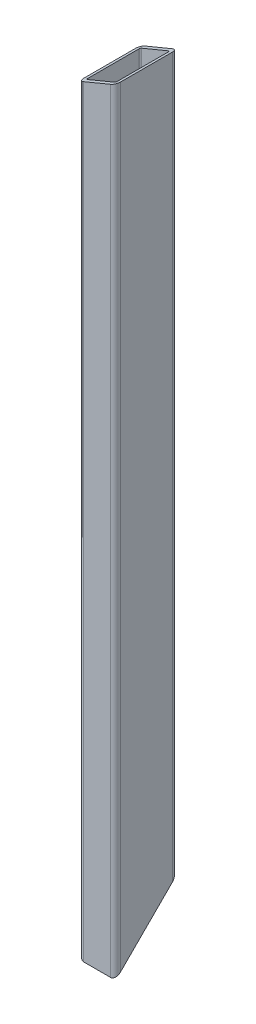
ISO-10303-21;
HEADER;
FILE_DESCRIPTION(('STEP AP214'),'2;1');
FILE_NAME('part.step','',(''),(''),'','','');
FILE_SCHEMA(('AUTOMOTIVE_DESIGN { 1 0 10303 214 1 1 1 1 }'));
ENDSEC;
DATA;
#1=APPLICATION_CONTEXT('core data for automotive mechanical design processes');
#2=APPLICATION_PROTOCOL_DEFINITION('international standard','automotive_design',2000,#1);
#3=PRODUCT_CONTEXT('',#1,'mechanical');
#4=PRODUCT('Part','Part','',(#3));
#5=PRODUCT_RELATED_PRODUCT_CATEGORY('part','',(#4));
#6=PRODUCT_DEFINITION_FORMATION('','',#4);
#7=PRODUCT_DEFINITION_CONTEXT('part definition',#1,'design');
#8=PRODUCT_DEFINITION('design','',#6,#7);
#9=PRODUCT_DEFINITION_SHAPE('','',#8);
#10=(LENGTH_UNIT() NAMED_UNIT(*) SI_UNIT(.MILLI.,.METRE.));
#11=(NAMED_UNIT(*) PLANE_ANGLE_UNIT() SI_UNIT($,.RADIAN.));
#12=(NAMED_UNIT(*) SI_UNIT($,.STERADIAN.) SOLID_ANGLE_UNIT());
#13=UNCERTAINTY_MEASURE_WITH_UNIT(LENGTH_MEASURE(1.E-05),#10,'distance_accuracy_value','');
#14=(GEOMETRIC_REPRESENTATION_CONTEXT(3) GLOBAL_UNCERTAINTY_ASSIGNED_CONTEXT((#13)) GLOBAL_UNIT_ASSIGNED_CONTEXT((#10,
#11,#12)) REPRESENTATION_CONTEXT('',''));
#15=CARTESIAN_POINT('',(0.,0.,0.));
#16=DIRECTION('',(0.,0.,1.));
#17=DIRECTION('',(1.,0.,0.));
#18=AXIS2_PLACEMENT_3D('',#15,#16,#17);
#19=CARTESIAN_POINT('',(-15.,0.,25.));
#20=DIRECTION('',(0.,0.707106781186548,0.707106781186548));
#21=DIRECTION('',(0.,-0.707106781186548,0.707106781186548));
#22=AXIS2_PLACEMENT_3D('',#19,#20,#21);
#23=PLANE('',#22);
#24=DIRECTION('',(0.,0.707106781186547,-0.707106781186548));
#25=VECTOR('',#24,1.);
#26=CARTESIAN_POINT('',(15.,4.,21.));
#27=LINE('',#26,#25);
#28=CARTESIAN_POINT('',(15.,4.,21.));
#29=VERTEX_POINT('',#28);
#30=CARTESIAN_POINT('',(15.,46.,-21.));
#31=VERTEX_POINT('',#30);
#32=EDGE_CURVE('E243',#29,#31,#27,.T.);
#33=ORIENTED_EDGE('',*,*,#32,.F.);
#34=CARTESIAN_POINT('',(11.,4.,21.));
#35=DIRECTION('',(0.,0.707106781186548,0.707106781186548));
#36=DIRECTION('',(0.,0.707106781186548,-0.707106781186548));
#37=AXIS2_PLACEMENT_3D('',#34,#35,#36);
#38=ELLIPSE('',#37,5.65685424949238,4.);
#39=CARTESIAN_POINT('',(11.,-6.76020863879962E-08,25.0000000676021));
#40=VERTEX_POINT('',#39);
#41=EDGE_CURVE('E213',#29,#40,#38,.F.);
#42=ORIENTED_EDGE('',*,*,#41,.T.);
#43=DIRECTION('',(1.,0.,0.));
#44=VECTOR('',#43,1.);
#45=CARTESIAN_POINT('',(-15.,-6.76020863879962E-08,25.0000000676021));
#46=LINE('',#45,#44);
#47=CARTESIAN_POINT('',(-11.,-6.76020863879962E-08,25.0000000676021));
#48=VERTEX_POINT('',#47);
#49=EDGE_CURVE('E246',#48,#40,#46,.T.);
#50=ORIENTED_EDGE('',*,*,#49,.F.);
#51=CARTESIAN_POINT('',(-11.,4.,21.));
#52=DIRECTION('',(0.,0.707106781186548,0.707106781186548));
#53=DIRECTION('',(0.,0.707106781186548,-0.707106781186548));
#54=AXIS2_PLACEMENT_3D('',#51,#52,#53);
#55=ELLIPSE('',#54,5.65685424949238,4.);
#56=CARTESIAN_POINT('',(-15.,4.,21.));
#57=VERTEX_POINT('',#56);
#58=EDGE_CURVE('E208',#48,#57,#55,.F.);
#59=ORIENTED_EDGE('',*,*,#58,.T.);
#60=DIRECTION('',(0.,-0.707106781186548,0.707106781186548));
#61=VECTOR('',#60,1.);
#62=CARTESIAN_POINT('',(-15.,0.,25.));
#63=LINE('',#62,#61);
#64=CARTESIAN_POINT('',(-15.,46.,-21.));
#65=VERTEX_POINT('',#64);
#66=EDGE_CURVE('E227',#65,#57,#63,.T.);
#67=ORIENTED_EDGE('',*,*,#66,.F.);
#68=CARTESIAN_POINT('',(-11.,46.,-21.));
#69=DIRECTION('',(0.,0.707106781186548,0.707106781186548));
#70=DIRECTION('',(0.,0.707106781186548,-0.707106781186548));
#71=AXIS2_PLACEMENT_3D('',#68,#69,#70);
#72=ELLIPSE('',#71,5.65685424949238,4.);
#73=CARTESIAN_POINT('',(-11.,50.,-25.));
#74=VERTEX_POINT('',#73);
#75=EDGE_CURVE('E57',#65,#74,#72,.F.);
#76=ORIENTED_EDGE('',*,*,#75,.T.);
#77=DIRECTION('',(1.,0.,0.));
#78=VECTOR('',#77,1.);
#79=CARTESIAN_POINT('',(-15.,50.,-25.));
#80=LINE('',#79,#78);
#81=CARTESIAN_POINT('',(11.,50.,-25.));
#82=VERTEX_POINT('',#81);
#83=EDGE_CURVE('E280',#82,#74,#80,.F.);
#84=ORIENTED_EDGE('',*,*,#83,.F.);
#85=CARTESIAN_POINT('',(11.,46.,-21.));
#86=DIRECTION('',(0.,0.707106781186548,0.707106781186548));
#87=DIRECTION('',(0.,0.707106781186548,-0.707106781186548));
#88=AXIS2_PLACEMENT_3D('',#85,#86,#87);
#89=ELLIPSE('',#88,5.65685424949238,4.);
#90=EDGE_CURVE('E210',#82,#31,#89,.F.);
#91=ORIENTED_EDGE('',*,*,#90,.T.);
#92=EDGE_LOOP('',(#33,#42,#50,#59,#67,#76,#84,#91));
#93=FACE_BOUND('',#92,.T.);
#94=DIRECTION('',(1.,0.,0.));
#95=VECTOR('',#94,1.);
#96=CARTESIAN_POINT('',(-15.,3.,22.));
#97=LINE('',#96,#95);
#98=CARTESIAN_POINT('',(11.,3.,22.));
#99=VERTEX_POINT('',#98);
#100=CARTESIAN_POINT('',(-11.,3.,22.));
#101=VERTEX_POINT('',#100);
#102=EDGE_CURVE('E339',#99,#101,#97,.F.);
#103=ORIENTED_EDGE('',*,*,#102,.F.);
#104=CARTESIAN_POINT('',(11.,4.00000000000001,21.));
#105=DIRECTION('',(0.,0.707106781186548,0.707106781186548));
#106=DIRECTION('',(0.,-0.707106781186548,0.707106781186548));
#107=AXIS2_PLACEMENT_3D('',#104,#105,#106);
#108=ELLIPSE('',#107,1.41421356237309,1.);
#109=CARTESIAN_POINT('',(12.,4.00000000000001,21.));
#110=VERTEX_POINT('',#109);
#111=EDGE_CURVE('E176',#99,#110,#108,.T.);
#112=ORIENTED_EDGE('',*,*,#111,.T.);
#113=DIRECTION('',(0.,-0.707106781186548,0.707106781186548));
#114=VECTOR('',#113,1.);
#115=CARTESIAN_POINT('',(12.,0.,25.));
#116=LINE('',#115,#114);
#117=CARTESIAN_POINT('',(12.,46.,-21.));
#118=VERTEX_POINT('',#117);
#119=EDGE_CURVE('E161',#118,#110,#116,.T.);
#120=ORIENTED_EDGE('',*,*,#119,.F.);
#121=CARTESIAN_POINT('',(11.,46.,-21.));
#122=DIRECTION('',(0.,0.707106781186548,0.707106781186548));
#123=DIRECTION('',(0.,-0.707106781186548,0.707106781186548));
#124=AXIS2_PLACEMENT_3D('',#121,#122,#123);
#125=ELLIPSE('',#124,1.41421356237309,1.);
#126=CARTESIAN_POINT('',(11.,47.,-22.));
#127=VERTEX_POINT('',#126);
#128=EDGE_CURVE('E173',#118,#127,#125,.T.);
#129=ORIENTED_EDGE('',*,*,#128,.T.);
#130=DIRECTION('',(1.,0.,0.));
#131=VECTOR('',#130,1.);
#132=CARTESIAN_POINT('',(-15.,47.,-22.));
#133=LINE('',#132,#131);
#134=CARTESIAN_POINT('',(-11.,47.,-22.));
#135=VERTEX_POINT('',#134);
#136=EDGE_CURVE('E311',#135,#127,#133,.T.);
#137=ORIENTED_EDGE('',*,*,#136,.F.);
#138=CARTESIAN_POINT('',(-11.,46.,-21.));
#139=DIRECTION('',(0.,0.707106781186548,0.707106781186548));
#140=DIRECTION('',(0.,-0.707106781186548,0.707106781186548));
#141=AXIS2_PLACEMENT_3D('',#138,#139,#140);
#142=ELLIPSE('',#141,1.41421356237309,1.);
#143=CARTESIAN_POINT('',(-12.,46.,-21.));
#144=VERTEX_POINT('',#143);
#145=EDGE_CURVE('E189',#135,#144,#142,.T.);
#146=ORIENTED_EDGE('',*,*,#145,.T.);
#147=DIRECTION('',(0.,-0.707106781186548,0.707106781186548));
#148=VECTOR('',#147,1.);
#149=CARTESIAN_POINT('',(-12.,0.,25.));
#150=LINE('',#149,#148);
#151=CARTESIAN_POINT('',(-12.,4.,21.));
#152=VERTEX_POINT('',#151);
#153=EDGE_CURVE('E309',#152,#144,#150,.F.);
#154=ORIENTED_EDGE('',*,*,#153,.F.);
#155=CARTESIAN_POINT('',(-11.,4.,21.));
#156=DIRECTION('',(0.,0.707106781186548,0.707106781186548));
#157=DIRECTION('',(0.,-0.707106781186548,0.707106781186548));
#158=AXIS2_PLACEMENT_3D('',#155,#156,#157);
#159=ELLIPSE('',#158,1.41421356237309,1.);
#160=EDGE_CURVE('E303',#152,#101,#159,.T.);
#161=ORIENTED_EDGE('',*,*,#160,.T.);
#162=EDGE_LOOP('',(#103,#112,#120,#129,#137,#146,#154,#161));
#163=FACE_BOUND('',#162,.T.);
#164=ADVANCED_FACE('F42',(#93,#163),#23,.F.);
#165=CARTESIAN_POINT('',(-15.,616.3735931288,25.));
#166=DIRECTION('',(0.382683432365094,-0.923879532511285,0.));
#167=DIRECTION('',(0.923879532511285,0.382683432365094,0.));
#168=AXIS2_PLACEMENT_3D('',#165,#166,#167);
#169=PLANE('',#168);
#170=DIRECTION('',(0.923879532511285,0.382683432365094,0.));
#171=VECTOR('',#170,1.);
#172=CARTESIAN_POINT('',(-15.,616.3735931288,25.));
#173=LINE('',#172,#171);
#174=CARTESIAN_POINT('',(11.,627.143145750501,25.));
#175=VERTEX_POINT('',#174);
#176=CARTESIAN_POINT('',(-11.,618.030447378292,25.));
#177=VERTEX_POINT('',#176);
#178=EDGE_CURVE('E238',#175,#177,#173,.F.);
#179=ORIENTED_EDGE('',*,*,#178,.F.);
#180=CARTESIAN_POINT('',(11.,627.143145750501,21.));
#181=DIRECTION('',(0.382683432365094,-0.923879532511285,0.));
#182=DIRECTION('',(0.923879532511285,0.382683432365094,0.));
#183=AXIS2_PLACEMENT_3D('',#180,#181,#182);
#184=ELLIPSE('',#183,4.32956880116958,4.);
#185=CARTESIAN_POINT('',(15.,628.800000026,21.));
#186=VERTEX_POINT('',#185);
#187=EDGE_CURVE('E201',#175,#186,#184,.F.);
#188=ORIENTED_EDGE('',*,*,#187,.T.);
#189=DIRECTION('',(0.,0.,-1.));
#190=VECTOR('',#189,1.);
#191=CARTESIAN_POINT('',(15.,628.800000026,21.));
#192=LINE('',#191,#190);
#193=CARTESIAN_POINT('',(15.,628.800000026,-21.));
#194=VERTEX_POINT('',#193);
#195=EDGE_CURVE('E168',#194,#186,#192,.F.);
#196=ORIENTED_EDGE('',*,*,#195,.F.);
#197=CARTESIAN_POINT('',(11.,627.143145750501,-21.));
#198=DIRECTION('',(0.382683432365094,-0.923879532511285,0.));
#199=DIRECTION('',(0.923879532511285,0.382683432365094,0.));
#200=AXIS2_PLACEMENT_3D('',#197,#198,#199);
#201=ELLIPSE('',#200,4.32956880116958,4.);
#202=CARTESIAN_POINT('',(11.,627.143145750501,-25.));
#203=VERTEX_POINT('',#202);
#204=EDGE_CURVE('E197',#194,#203,#201,.F.);
#205=ORIENTED_EDGE('',*,*,#204,.T.);
#206=DIRECTION('',(0.923879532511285,0.382683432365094,0.));
#207=VECTOR('',#206,1.);
#208=CARTESIAN_POINT('',(-15.,616.3735931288,-25.));
#209=LINE('',#208,#207);
#210=CARTESIAN_POINT('',(-11.,618.030447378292,-25.));
#211=VERTEX_POINT('',#210);
#212=EDGE_CURVE('E237',#211,#203,#209,.T.);
#213=ORIENTED_EDGE('',*,*,#212,.F.);
#214=CARTESIAN_POINT('',(-11.,618.030447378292,-21.));
#215=DIRECTION('',(0.382683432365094,-0.923879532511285,0.));
#216=DIRECTION('',(0.923879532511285,0.382683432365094,0.));
#217=AXIS2_PLACEMENT_3D('',#214,#215,#216);
#218=ELLIPSE('',#217,4.32956880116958,4.);
#219=CARTESIAN_POINT('',(-15.,616.3735931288,-21.));
#220=VERTEX_POINT('',#219);
#221=EDGE_CURVE('E199',#211,#220,#218,.F.);
#222=ORIENTED_EDGE('',*,*,#221,.T.);
#223=DIRECTION('',(0.,0.,1.));
#224=VECTOR('',#223,1.);
#225=CARTESIAN_POINT('',(-15.,616.3735931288,25.));
#226=LINE('',#225,#224);
#227=CARTESIAN_POINT('',(-15.,616.3735931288,21.));
#228=VERTEX_POINT('',#227);
#229=EDGE_CURVE('E225',#228,#220,#226,.F.);
#230=ORIENTED_EDGE('',*,*,#229,.F.);
#231=CARTESIAN_POINT('',(-11.,618.030447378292,21.));
#232=DIRECTION('',(0.382683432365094,-0.923879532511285,0.));
#233=DIRECTION('',(0.923879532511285,0.382683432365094,0.));
#234=AXIS2_PLACEMENT_3D('',#231,#232,#233);
#235=ELLIPSE('',#234,4.32956880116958,4.);
#236=EDGE_CURVE('E195',#228,#177,#235,.F.);
#237=ORIENTED_EDGE('',*,*,#236,.T.);
#238=EDGE_LOOP('',(#179,#188,#196,#205,#213,#222,#230,#237));
#239=FACE_BOUND('',#238,.T.);
#240=DIRECTION('',(0.923879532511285,0.382683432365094,0.));
#241=VECTOR('',#240,1.);
#242=CARTESIAN_POINT('',(-15.,616.3735931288,22.));
#243=LINE('',#242,#241);
#244=CARTESIAN_POINT('',(-11.,618.030447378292,22.));
#245=VERTEX_POINT('',#244);
#246=CARTESIAN_POINT('',(11.,627.143145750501,22.));
#247=VERTEX_POINT('',#246);
#248=EDGE_CURVE('E282',#245,#247,#243,.T.);
#249=ORIENTED_EDGE('',*,*,#248,.F.);
#250=CARTESIAN_POINT('',(-11.,618.030447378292,21.));
#251=DIRECTION('',(0.382683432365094,-0.923879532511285,0.));
#252=DIRECTION('',(-0.923879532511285,-0.382683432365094,0.));
#253=AXIS2_PLACEMENT_3D('',#250,#251,#252);
#254=ELLIPSE('',#253,1.0823922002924,1.);
#255=CARTESIAN_POINT('',(-12.0000000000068,617.616233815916,21.));
#256=VERTEX_POINT('',#255);
#257=EDGE_CURVE('E301',#245,#256,#254,.T.);
#258=ORIENTED_EDGE('',*,*,#257,.T.);
#259=DIRECTION('',(0.,0.,1.));
#260=VECTOR('',#259,1.);
#261=CARTESIAN_POINT('',(-12.0000000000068,617.616233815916,25.));
#262=LINE('',#261,#260);
#263=CARTESIAN_POINT('',(-12.0000000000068,617.616233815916,-21.));
#264=VERTEX_POINT('',#263);
#265=EDGE_CURVE('E321',#264,#256,#262,.T.);
#266=ORIENTED_EDGE('',*,*,#265,.F.);
#267=CARTESIAN_POINT('',(-11.,618.030447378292,-21.));
#268=DIRECTION('',(0.382683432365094,-0.923879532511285,0.));
#269=DIRECTION('',(-0.923879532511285,-0.382683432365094,0.));
#270=AXIS2_PLACEMENT_3D('',#267,#268,#269);
#271=ELLIPSE('',#270,1.0823922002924,1.);
#272=CARTESIAN_POINT('',(-11.,618.030447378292,-22.));
#273=VERTEX_POINT('',#272);
#274=EDGE_CURVE('E305',#264,#273,#271,.T.);
#275=ORIENTED_EDGE('',*,*,#274,.T.);
#276=DIRECTION('',(0.923879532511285,0.382683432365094,0.));
#277=VECTOR('',#276,1.);
#278=CARTESIAN_POINT('',(-15.,616.3735931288,-22.));
#279=LINE('',#278,#277);
#280=CARTESIAN_POINT('',(11.,627.143145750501,-22.));
#281=VERTEX_POINT('',#280);
#282=EDGE_CURVE('E178',#281,#273,#279,.F.);
#283=ORIENTED_EDGE('',*,*,#282,.F.);
#284=CARTESIAN_POINT('',(11.,627.143145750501,-21.));
#285=DIRECTION('',(0.382683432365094,-0.923879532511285,0.));
#286=DIRECTION('',(-0.923879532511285,-0.382683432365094,0.));
#287=AXIS2_PLACEMENT_3D('',#284,#285,#286);
#288=ELLIPSE('',#287,1.0823922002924,1.);
#289=CARTESIAN_POINT('',(12.0000000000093,627.557359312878,-21.));
#290=VERTEX_POINT('',#289);
#291=EDGE_CURVE('E185',#281,#290,#288,.T.);
#292=ORIENTED_EDGE('',*,*,#291,.T.);
#293=DIRECTION('',(0.,0.,1.));
#294=VECTOR('',#293,1.);
#295=CARTESIAN_POINT('',(12.0000000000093,627.557359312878,25.));
#296=LINE('',#295,#294);
#297=CARTESIAN_POINT('',(12.0000000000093,627.557359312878,21.));
#298=VERTEX_POINT('',#297);
#299=EDGE_CURVE('E164',#298,#290,#296,.F.);
#300=ORIENTED_EDGE('',*,*,#299,.F.);
#301=CARTESIAN_POINT('',(11.,627.143145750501,21.));
#302=DIRECTION('',(0.382683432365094,-0.923879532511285,0.));
#303=DIRECTION('',(-0.923879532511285,-0.382683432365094,0.));
#304=AXIS2_PLACEMENT_3D('',#301,#302,#303);
#305=ELLIPSE('',#304,1.0823922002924,1.);
#306=EDGE_CURVE('E298',#298,#247,#305,.T.);
#307=ORIENTED_EDGE('',*,*,#306,.T.);
#308=EDGE_LOOP('',(#249,#258,#266,#275,#283,#292,#300,#307));
#309=FACE_BOUND('',#308,.T.);
#310=ADVANCED_FACE('F232',(#239,#309),#169,.F.);
#311=CARTESIAN_POINT('',(-11.,0.,25.));
#312=DIRECTION('',(0.,0.,1.));
#313=DIRECTION('',(1.,0.,0.));
#314=AXIS2_PLACEMENT_3D('',#311,#312,#313);
#315=PLANE('',#314);
#316=ORIENTED_EDGE('',*,*,#49,.T.);
#317=DIRECTION('',(0.,1.,0.));
#318=VECTOR('',#317,1.);
#319=CARTESIAN_POINT('',(11.,0.,25.));
#320=LINE('',#319,#318);
#321=EDGE_CURVE('E187',#40,#175,#320,.T.);
#322=ORIENTED_EDGE('',*,*,#321,.T.);
#323=ORIENTED_EDGE('',*,*,#178,.T.);
#324=DIRECTION('',(0.,1.,0.));
#325=VECTOR('',#324,1.);
#326=CARTESIAN_POINT('',(-11.,0.,25.));
#327=LINE('',#326,#325);
#328=EDGE_CURVE('E184',#177,#48,#327,.F.);
#329=ORIENTED_EDGE('',*,*,#328,.T.);
#330=EDGE_LOOP('',(#316,#322,#323,#329));
#331=FACE_BOUND('',#330,.T.);
#332=ADVANCED_FACE('F368',(#331),#315,.T.);
#333=CARTESIAN_POINT('',(-15.,0.,-21.));
#334=DIRECTION('',(-1.,0.,0.));
#335=DIRECTION('',(0.,0.,1.));
#336=AXIS2_PLACEMENT_3D('',#333,#334,#335);
#337=PLANE('',#336);
#338=ORIENTED_EDGE('',*,*,#229,.T.);
#339=DIRECTION('',(0.,1.,0.));
#340=VECTOR('',#339,1.);
#341=CARTESIAN_POINT('',(-15.,0.,-21.));
#342=LINE('',#341,#340);
#343=EDGE_CURVE('E12',#220,#65,#342,.F.);
#344=ORIENTED_EDGE('',*,*,#343,.T.);
#345=ORIENTED_EDGE('',*,*,#66,.T.);
#346=DIRECTION('',(0.,1.,0.));
#347=VECTOR('',#346,1.);
#348=CARTESIAN_POINT('',(-15.,0.,21.));
#349=LINE('',#348,#347);
#350=EDGE_CURVE('E50',#57,#228,#349,.T.);
#351=ORIENTED_EDGE('',*,*,#350,.T.);
#352=EDGE_LOOP('',(#338,#344,#345,#351));
#353=FACE_BOUND('',#352,.T.);
#354=ADVANCED_FACE('F224',(#353),#337,.T.);
#355=CARTESIAN_POINT('',(11.,0.,-25.));
#356=DIRECTION('',(0.,0.,-1.));
#357=DIRECTION('',(-1.,0.,0.));
#358=AXIS2_PLACEMENT_3D('',#355,#356,#357);
#359=PLANE('',#358);
#360=ORIENTED_EDGE('',*,*,#83,.T.);
#361=DIRECTION('',(0.,1.,0.));
#362=VECTOR('',#361,1.);
#363=CARTESIAN_POINT('',(-11.,0.,-25.));
#364=LINE('',#363,#362);
#365=EDGE_CURVE('E216',#74,#211,#364,.T.);
#366=ORIENTED_EDGE('',*,*,#365,.T.);
#367=ORIENTED_EDGE('',*,*,#212,.T.);
#368=DIRECTION('',(0.,1.,0.));
#369=VECTOR('',#368,1.);
#370=CARTESIAN_POINT('',(11.,0.,-25.));
#371=LINE('',#370,#369);
#372=EDGE_CURVE('E64',#203,#82,#371,.F.);
#373=ORIENTED_EDGE('',*,*,#372,.T.);
#374=EDGE_LOOP('',(#360,#366,#367,#373));
#375=FACE_BOUND('',#374,.T.);
#376=ADVANCED_FACE('F374',(#375),#359,.T.);
#377=CARTESIAN_POINT('',(15.,0.,21.));
#378=DIRECTION('',(1.,0.,0.));
#379=DIRECTION('',(0.,0.,-1.));
#380=AXIS2_PLACEMENT_3D('',#377,#378,#379);
#381=PLANE('',#380);
#382=ORIENTED_EDGE('',*,*,#195,.T.);
#383=DIRECTION('',(0.,1.,0.));
#384=VECTOR('',#383,1.);
#385=CARTESIAN_POINT('',(15.,0.,21.));
#386=LINE('',#385,#384);
#387=EDGE_CURVE('E206',#186,#29,#386,.F.);
#388=ORIENTED_EDGE('',*,*,#387,.T.);
#389=ORIENTED_EDGE('',*,*,#32,.T.);
#390=DIRECTION('',(0.,1.,0.));
#391=VECTOR('',#390,1.);
#392=CARTESIAN_POINT('',(15.,0.,-21.));
#393=LINE('',#392,#391);
#394=EDGE_CURVE('E203',#31,#194,#393,.T.);
#395=ORIENTED_EDGE('',*,*,#394,.T.);
#396=EDGE_LOOP('',(#382,#388,#389,#395));
#397=FACE_BOUND('',#396,.T.);
#398=ADVANCED_FACE('F370',(#397),#381,.T.);
#399=CARTESIAN_POINT('',(11.,0.,22.));
#400=DIRECTION('',(0.,0.,-1.));
#401=DIRECTION('',(-1.,0.,0.));
#402=AXIS2_PLACEMENT_3D('',#399,#400,#401);
#403=PLANE('',#402);
#404=ORIENTED_EDGE('',*,*,#248,.T.);
#405=DIRECTION('',(0.,1.,0.));
#406=VECTOR('',#405,1.);
#407=CARTESIAN_POINT('',(11.,3.,22.));
#408=LINE('',#407,#406);
#409=EDGE_CURVE('E288',#247,#99,#408,.F.);
#410=ORIENTED_EDGE('',*,*,#409,.T.);
#411=ORIENTED_EDGE('',*,*,#102,.T.);
#412=DIRECTION('',(0.,1.,0.));
#413=VECTOR('',#412,1.);
#414=CARTESIAN_POINT('',(-11.,617.616233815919,22.));
#415=LINE('',#414,#413);
#416=EDGE_CURVE('E285',#101,#245,#415,.T.);
#417=ORIENTED_EDGE('',*,*,#416,.T.);
#418=EDGE_LOOP('',(#404,#410,#411,#417));
#419=FACE_BOUND('',#418,.T.);
#420=ADVANCED_FACE('F347',(#419),#403,.T.);
#421=CARTESIAN_POINT('',(12.,0.,-21.));
#422=DIRECTION('',(-1.,0.,0.));
#423=DIRECTION('',(0.,0.,1.));
#424=AXIS2_PLACEMENT_3D('',#421,#422,#423);
#425=PLANE('',#424);
#426=ORIENTED_EDGE('',*,*,#119,.T.);
#427=DIRECTION('',(0.,1.,0.));
#428=VECTOR('',#427,1.);
#429=CARTESIAN_POINT('',(12.,627.557359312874,21.));
#430=LINE('',#429,#428);
#431=EDGE_CURVE('E167',#110,#298,#430,.T.);
#432=ORIENTED_EDGE('',*,*,#431,.T.);
#433=ORIENTED_EDGE('',*,*,#299,.T.);
#434=DIRECTION('',(0.,1.,0.));
#435=VECTOR('',#434,1.);
#436=CARTESIAN_POINT('',(12.,47.,-21.));
#437=LINE('',#436,#435);
#438=EDGE_CURVE('E157',#290,#118,#437,.F.);
#439=ORIENTED_EDGE('',*,*,#438,.T.);
#440=EDGE_LOOP('',(#426,#432,#433,#439));
#441=FACE_BOUND('',#440,.T.);
#442=ADVANCED_FACE('F159',(#441),#425,.T.);
#443=CARTESIAN_POINT('',(-11.,0.,-22.));
#444=DIRECTION('',(0.,0.,1.));
#445=DIRECTION('',(1.,0.,0.));
#446=AXIS2_PLACEMENT_3D('',#443,#444,#445);
#447=PLANE('',#446);
#448=ORIENTED_EDGE('',*,*,#282,.T.);
#449=DIRECTION('',(0.,1.,0.));
#450=VECTOR('',#449,1.);
#451=CARTESIAN_POINT('',(-11.,47.,-22.));
#452=LINE('',#451,#450);
#453=EDGE_CURVE('E296',#273,#135,#452,.F.);
#454=ORIENTED_EDGE('',*,*,#453,.T.);
#455=ORIENTED_EDGE('',*,*,#136,.T.);
#456=DIRECTION('',(0.,1.,0.));
#457=VECTOR('',#456,1.);
#458=CARTESIAN_POINT('',(11.,627.557359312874,-22.));
#459=LINE('',#458,#457);
#460=EDGE_CURVE('E183',#127,#281,#459,.T.);
#461=ORIENTED_EDGE('',*,*,#460,.T.);
#462=EDGE_LOOP('',(#448,#454,#455,#461));
#463=FACE_BOUND('',#462,.T.);
#464=ADVANCED_FACE('F328',(#463),#447,.T.);
#465=CARTESIAN_POINT('',(-12.,0.,21.));
#466=DIRECTION('',(1.,0.,0.));
#467=DIRECTION('',(0.,0.,-1.));
#468=AXIS2_PLACEMENT_3D('',#465,#466,#467);
#469=PLANE('',#468);
#470=ORIENTED_EDGE('',*,*,#265,.T.);
#471=DIRECTION('',(0.,1.,0.));
#472=VECTOR('',#471,1.);
#473=CARTESIAN_POINT('',(-12.,3.,21.));
#474=LINE('',#473,#472);
#475=EDGE_CURVE('E293',#256,#152,#474,.F.);
#476=ORIENTED_EDGE('',*,*,#475,.T.);
#477=ORIENTED_EDGE('',*,*,#153,.T.);
#478=DIRECTION('',(0.,1.,0.));
#479=VECTOR('',#478,1.);
#480=CARTESIAN_POINT('',(-12.,617.616233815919,-21.));
#481=LINE('',#480,#479);
#482=EDGE_CURVE('E290',#144,#264,#481,.T.);
#483=ORIENTED_EDGE('',*,*,#482,.T.);
#484=EDGE_LOOP('',(#470,#476,#477,#483));
#485=FACE_BOUND('',#484,.T.);
#486=ADVANCED_FACE('F317',(#485),#469,.T.);
#487=CARTESIAN_POINT('',(11.,0.,21.));
#488=DIRECTION('',(0.,-1.,0.));
#489=DIRECTION('',(0.,0.,-1.));
#490=AXIS2_PLACEMENT_3D('',#487,#488,#489);
#491=CYLINDRICAL_SURFACE('',#490,1.);
#492=ORIENTED_EDGE('',*,*,#111,.F.);
#493=ORIENTED_EDGE('',*,*,#409,.F.);
#494=ORIENTED_EDGE('',*,*,#306,.F.);
#495=ORIENTED_EDGE('',*,*,#431,.F.);
#496=EDGE_LOOP('',(#492,#493,#494,#495));
#497=FACE_BOUND('',#496,.T.);
#498=ADVANCED_FACE('F350',(#497),#491,.F.);
#499=CARTESIAN_POINT('',(-11.,0.,21.));
#500=DIRECTION('',(0.,-1.,0.));
#501=DIRECTION('',(0.,0.,-1.));
#502=AXIS2_PLACEMENT_3D('',#499,#500,#501);
#503=CYLINDRICAL_SURFACE('',#502,1.);
#504=ORIENTED_EDGE('',*,*,#160,.F.);
#505=ORIENTED_EDGE('',*,*,#475,.F.);
#506=ORIENTED_EDGE('',*,*,#257,.F.);
#507=ORIENTED_EDGE('',*,*,#416,.F.);
#508=EDGE_LOOP('',(#504,#505,#506,#507));
#509=FACE_BOUND('',#508,.T.);
#510=ADVANCED_FACE('F352',(#509),#503,.F.);
#511=CARTESIAN_POINT('',(-11.,0.,-21.));
#512=DIRECTION('',(0.,-1.,0.));
#513=DIRECTION('',(0.,0.,-1.));
#514=AXIS2_PLACEMENT_3D('',#511,#512,#513);
#515=CYLINDRICAL_SURFACE('',#514,1.);
#516=ORIENTED_EDGE('',*,*,#145,.F.);
#517=ORIENTED_EDGE('',*,*,#453,.F.);
#518=ORIENTED_EDGE('',*,*,#274,.F.);
#519=ORIENTED_EDGE('',*,*,#482,.F.);
#520=EDGE_LOOP('',(#516,#517,#518,#519));
#521=FACE_BOUND('',#520,.T.);
#522=ADVANCED_FACE('F323',(#521),#515,.F.);
#523=CARTESIAN_POINT('',(11.,0.,-21.));
#524=DIRECTION('',(0.,-1.,0.));
#525=DIRECTION('',(0.,0.,-1.));
#526=AXIS2_PLACEMENT_3D('',#523,#524,#525);
#527=CYLINDRICAL_SURFACE('',#526,1.);
#528=ORIENTED_EDGE('',*,*,#128,.F.);
#529=ORIENTED_EDGE('',*,*,#438,.F.);
#530=ORIENTED_EDGE('',*,*,#291,.F.);
#531=ORIENTED_EDGE('',*,*,#460,.F.);
#532=EDGE_LOOP('',(#528,#529,#530,#531));
#533=FACE_BOUND('',#532,.T.);
#534=ADVANCED_FACE('F181',(#533),#527,.F.);
#535=CARTESIAN_POINT('',(11.,0.,21.));
#536=DIRECTION('',(0.,1.,0.));
#537=DIRECTION('',(0.,0.,1.));
#538=AXIS2_PLACEMENT_3D('',#535,#536,#537);
#539=CYLINDRICAL_SURFACE('',#538,4.);
#540=ORIENTED_EDGE('',*,*,#41,.F.);
#541=ORIENTED_EDGE('',*,*,#387,.F.);
#542=ORIENTED_EDGE('',*,*,#187,.F.);
#543=ORIENTED_EDGE('',*,*,#321,.F.);
#544=EDGE_LOOP('',(#540,#541,#542,#543));
#545=FACE_BOUND('',#544,.T.);
#546=ADVANCED_FACE('F429',(#545),#539,.T.);
#547=CARTESIAN_POINT('',(-11.,0.,-21.));
#548=DIRECTION('',(0.,1.,0.));
#549=DIRECTION('',(0.,0.,1.));
#550=AXIS2_PLACEMENT_3D('',#547,#548,#549);
#551=CYLINDRICAL_SURFACE('',#550,4.);
#552=ORIENTED_EDGE('',*,*,#75,.F.);
#553=ORIENTED_EDGE('',*,*,#343,.F.);
#554=ORIENTED_EDGE('',*,*,#221,.F.);
#555=ORIENTED_EDGE('',*,*,#365,.F.);
#556=EDGE_LOOP('',(#552,#553,#554,#555));
#557=FACE_BOUND('',#556,.T.);
#558=ADVANCED_FACE('F486',(#557),#551,.T.);
#559=CARTESIAN_POINT('',(11.,0.,-21.));
#560=DIRECTION('',(0.,1.,0.));
#561=DIRECTION('',(0.,0.,1.));
#562=AXIS2_PLACEMENT_3D('',#559,#560,#561);
#563=CYLINDRICAL_SURFACE('',#562,4.);
#564=ORIENTED_EDGE('',*,*,#90,.F.);
#565=ORIENTED_EDGE('',*,*,#372,.F.);
#566=ORIENTED_EDGE('',*,*,#204,.F.);
#567=ORIENTED_EDGE('',*,*,#394,.F.);
#568=EDGE_LOOP('',(#564,#565,#566,#567));
#569=FACE_BOUND('',#568,.T.);
#570=ADVANCED_FACE('F496',(#569),#563,.T.);
#571=CARTESIAN_POINT('',(-11.,0.,21.));
#572=DIRECTION('',(0.,1.,0.));
#573=DIRECTION('',(0.,0.,1.));
#574=AXIS2_PLACEMENT_3D('',#571,#572,#573);
#575=CYLINDRICAL_SURFACE('',#574,4.);
#576=ORIENTED_EDGE('',*,*,#58,.F.);
#577=ORIENTED_EDGE('',*,*,#328,.F.);
#578=ORIENTED_EDGE('',*,*,#236,.F.);
#579=ORIENTED_EDGE('',*,*,#350,.F.);
#580=EDGE_LOOP('',(#576,#577,#578,#579));
#581=FACE_BOUND('',#580,.T.);
#582=ADVANCED_FACE('F44',(#581),#575,.T.);
#583=CLOSED_SHELL('',(#164,#310,#332,#354,#376,#398,#420,#442,#464,#486,#498,#510,#522,#534,
#546,#558,#570,#582));
#584=MANIFOLD_SOLID_BREP('B2',#583);
#585=ADVANCED_BREP_SHAPE_REPRESENTATION('',(#18,#584),#14);
#586=SHAPE_DEFINITION_REPRESENTATION(#9,#585);
ENDSEC;
END-ISO-10303-21;
